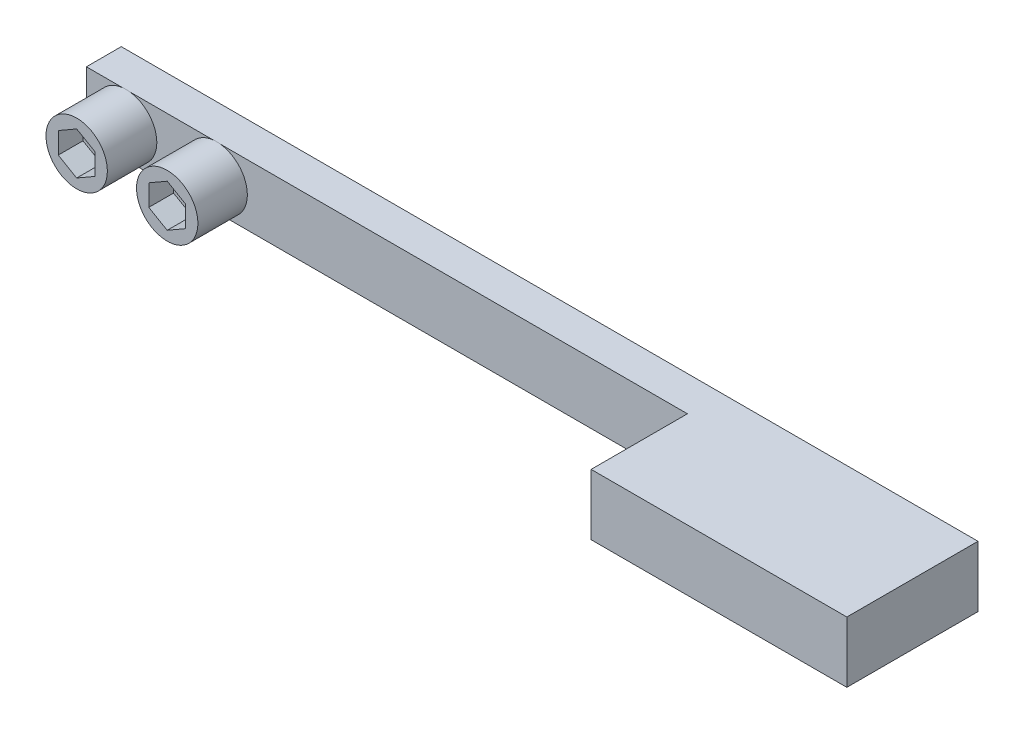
ISO-10303-21;
HEADER;
FILE_DESCRIPTION(('STEP AP214'),'2;1');
FILE_NAME('part.step','',(''),(''),'','','');
FILE_SCHEMA(('AUTOMOTIVE_DESIGN { 1 0 10303 214 1 1 1 1 }'));
ENDSEC;
DATA;
#1=APPLICATION_CONTEXT('core data for automotive mechanical design processes');
#2=APPLICATION_PROTOCOL_DEFINITION('international standard','automotive_design',2000,#1);
#3=PRODUCT_CONTEXT('',#1,'mechanical');
#4=PRODUCT('Part','Part','',(#3));
#5=PRODUCT_RELATED_PRODUCT_CATEGORY('part','',(#4));
#6=PRODUCT_DEFINITION_FORMATION('','',#4);
#7=PRODUCT_DEFINITION_CONTEXT('part definition',#1,'design');
#8=PRODUCT_DEFINITION('design','',#6,#7);
#9=PRODUCT_DEFINITION_SHAPE('','',#8);
#10=(LENGTH_UNIT() NAMED_UNIT(*) SI_UNIT(.MILLI.,.METRE.));
#11=(NAMED_UNIT(*) PLANE_ANGLE_UNIT() SI_UNIT($,.RADIAN.));
#12=(NAMED_UNIT(*) SI_UNIT($,.STERADIAN.) SOLID_ANGLE_UNIT());
#13=UNCERTAINTY_MEASURE_WITH_UNIT(LENGTH_MEASURE(1.E-05),#10,'distance_accuracy_value','');
#14=(GEOMETRIC_REPRESENTATION_CONTEXT(3) GLOBAL_UNCERTAINTY_ASSIGNED_CONTEXT((#13)) GLOBAL_UNIT_ASSIGNED_CONTEXT((#10,
#11,#12)) REPRESENTATION_CONTEXT('',''));
#15=CARTESIAN_POINT('',(0.,0.,0.));
#16=DIRECTION('',(0.,0.,1.));
#17=DIRECTION('',(1.,0.,0.));
#18=AXIS2_PLACEMENT_3D('',#15,#16,#17);
#19=CARTESIAN_POINT('',(-24.638,1.7526,1.0033));
#20=DIRECTION('',(0.,0.,-1.));
#21=DIRECTION('',(-1.,0.,0.));
#22=AXIS2_PLACEMENT_3D('',#19,#20,#21);
#23=PLANE('',#22);
#24=CARTESIAN_POINT('',(-17.145,0.,1.0033));
#25=DIRECTION('',(0.,0.,1.));
#26=DIRECTION('',(1.,0.,0.));
#27=AXIS2_PLACEMENT_3D('',#24,#25,#26);
#28=CIRCLE('',#27,1.7653);
#29=CARTESIAN_POINT('',(-16.9336298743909,-1.7526,1.0033));
#30=VERTEX_POINT('',#29);
#31=CARTESIAN_POINT('',(-16.9336298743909,1.7526,1.0033));
#32=VERTEX_POINT('',#31);
#33=EDGE_CURVE('E230',#30,#32,#28,.T.);
#34=ORIENTED_EDGE('',*,*,#33,.F.);
#35=DIRECTION('',(1.,0.,0.));
#36=VECTOR('',#35,1.);
#37=CARTESIAN_POINT('',(-24.638,-1.7526,1.0033));
#38=LINE('',#37,#36);
#39=CARTESIAN_POINT('',(9.9314,-1.7526,1.0033));
#40=VERTEX_POINT('',#39);
#41=EDGE_CURVE('E328',#30,#40,#38,.T.);
#42=ORIENTED_EDGE('',*,*,#41,.T.);
#43=DIRECTION('',(0.,-1.,0.));
#44=VECTOR('',#43,1.);
#45=CARTESIAN_POINT('',(9.9314,1.7526,1.0033));
#46=LINE('',#45,#44);
#47=CARTESIAN_POINT('',(9.9314,1.7526,1.0033));
#48=VERTEX_POINT('',#47);
#49=EDGE_CURVE('E346',#48,#40,#46,.T.);
#50=ORIENTED_EDGE('',*,*,#49,.F.);
#51=DIRECTION('',(1.,0.,0.));
#52=VECTOR('',#51,1.);
#53=CARTESIAN_POINT('',(-24.638,1.7526,1.0033));
#54=LINE('',#53,#52);
#55=EDGE_CURVE('E56',#32,#48,#54,.T.);
#56=ORIENTED_EDGE('',*,*,#55,.F.);
#57=EDGE_LOOP('',(#34,#42,#50,#56));
#58=FACE_BOUND('',#57,.T.);
#59=ADVANCED_FACE('F33',(#58),#23,.F.);
#60=CARTESIAN_POINT('',(-17.3563701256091,1.7526,1.0033));
#61=VERTEX_POINT('',#60);
#62=CARTESIAN_POINT('',(-17.3563701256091,-1.7526,1.0033));
#63=VERTEX_POINT('',#62);
#64=EDGE_CURVE('E245',#61,#63,#28,.T.);
#65=ORIENTED_EDGE('',*,*,#64,.F.);
#66=CARTESIAN_POINT('',(-22.1406298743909,1.7526,1.0033));
#67=VERTEX_POINT('',#66);
#68=EDGE_CURVE('E317',#67,#61,#54,.T.);
#69=ORIENTED_EDGE('',*,*,#68,.F.);
#70=CARTESIAN_POINT('',(-22.352,0.,1.0033));
#71=DIRECTION('',(0.,0.,1.));
#72=DIRECTION('',(1.,0.,0.));
#73=AXIS2_PLACEMENT_3D('',#70,#71,#72);
#74=CIRCLE('',#73,1.7653);
#75=CARTESIAN_POINT('',(-22.1406298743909,-1.7526,1.0033));
#76=VERTEX_POINT('',#75);
#77=EDGE_CURVE('E285',#76,#67,#74,.T.);
#78=ORIENTED_EDGE('',*,*,#77,.F.);
#79=EDGE_CURVE('E361',#76,#63,#38,.T.);
#80=ORIENTED_EDGE('',*,*,#79,.T.);
#81=EDGE_LOOP('',(#65,#69,#78,#80));
#82=FACE_BOUND('',#81,.T.);
#83=ADVANCED_FACE('F419',(#82),#23,.F.);
#84=CARTESIAN_POINT('',(-22.5633701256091,1.7526,1.0033));
#85=VERTEX_POINT('',#84);
#86=CARTESIAN_POINT('',(-22.5633701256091,-1.7526,1.0033));
#87=VERTEX_POINT('',#86);
#88=EDGE_CURVE('E303',#85,#87,#74,.T.);
#89=ORIENTED_EDGE('',*,*,#88,.F.);
#90=CARTESIAN_POINT('',(-24.638,1.7526,1.0033));
#91=VERTEX_POINT('',#90);
#92=EDGE_CURVE('E313',#91,#85,#54,.T.);
#93=ORIENTED_EDGE('',*,*,#92,.F.);
#94=DIRECTION('',(0.,-1.,0.));
#95=VECTOR('',#94,1.);
#96=CARTESIAN_POINT('',(-24.638,1.7526,1.0033));
#97=LINE('',#96,#95);
#98=CARTESIAN_POINT('',(-24.638,-1.7526,1.0033));
#99=VERTEX_POINT('',#98);
#100=EDGE_CURVE('E41',#91,#99,#97,.T.);
#101=ORIENTED_EDGE('',*,*,#100,.T.);
#102=EDGE_CURVE('E329',#99,#87,#38,.T.);
#103=ORIENTED_EDGE('',*,*,#102,.T.);
#104=EDGE_LOOP('',(#89,#93,#101,#103));
#105=FACE_BOUND('',#104,.T.);
#106=ADVANCED_FACE('F353',(#105),#23,.F.);
#107=CARTESIAN_POINT('',(24.638,1.7526,-1.0033));
#108=DIRECTION('',(0.,0.,1.));
#109=DIRECTION('',(1.,0.,0.));
#110=AXIS2_PLACEMENT_3D('',#107,#108,#109);
#111=PLANE('',#110);
#112=DIRECTION('',(-1.,0.,0.));
#113=VECTOR('',#112,1.);
#114=CARTESIAN_POINT('',(24.638,-1.7526,-1.0033));
#115=LINE('',#114,#113);
#116=CARTESIAN_POINT('',(24.638,-1.7526,-1.0033));
#117=VERTEX_POINT('',#116);
#118=CARTESIAN_POINT('',(-24.638,-1.7526,-1.0033));
#119=VERTEX_POINT('',#118);
#120=EDGE_CURVE('E306',#117,#119,#115,.T.);
#121=ORIENTED_EDGE('',*,*,#120,.T.);
#122=DIRECTION('',(0.,-1.,0.));
#123=VECTOR('',#122,1.);
#124=CARTESIAN_POINT('',(-24.638,1.7526,-1.0033));
#125=LINE('',#124,#123);
#126=CARTESIAN_POINT('',(-24.638,1.7526,-1.0033));
#127=VERTEX_POINT('',#126);
#128=EDGE_CURVE('E11',#127,#119,#125,.T.);
#129=ORIENTED_EDGE('',*,*,#128,.F.);
#130=DIRECTION('',(-1.,0.,0.));
#131=VECTOR('',#130,1.);
#132=CARTESIAN_POINT('',(24.638,1.7526,-1.0033));
#133=LINE('',#132,#131);
#134=CARTESIAN_POINT('',(24.638,1.7526,-1.0033));
#135=VERTEX_POINT('',#134);
#136=EDGE_CURVE('E307',#135,#127,#133,.T.);
#137=ORIENTED_EDGE('',*,*,#136,.F.);
#138=DIRECTION('',(0.,-1.,0.));
#139=VECTOR('',#138,1.);
#140=CARTESIAN_POINT('',(24.638,1.7526,-1.0033));
#141=LINE('',#140,#139);
#142=EDGE_CURVE('E323',#135,#117,#141,.T.);
#143=ORIENTED_EDGE('',*,*,#142,.T.);
#144=EDGE_LOOP('',(#121,#129,#137,#143));
#145=FACE_BOUND('',#144,.T.);
#146=ADVANCED_FACE('F35',(#145),#111,.F.);
#147=CARTESIAN_POINT('',(-24.638,1.7526,-1.0033));
#148=DIRECTION('',(1.,0.,0.));
#149=DIRECTION('',(0.,0.,-1.));
#150=AXIS2_PLACEMENT_3D('',#147,#148,#149);
#151=PLANE('',#150);
#152=DIRECTION('',(0.,0.,1.));
#153=VECTOR('',#152,1.);
#154=CARTESIAN_POINT('',(-24.638,-1.7526,-1.0033));
#155=LINE('',#154,#153);
#156=EDGE_CURVE('E326',#119,#99,#155,.T.);
#157=ORIENTED_EDGE('',*,*,#156,.T.);
#158=ORIENTED_EDGE('',*,*,#100,.F.);
#159=DIRECTION('',(0.,0.,1.));
#160=VECTOR('',#159,1.);
#161=CARTESIAN_POINT('',(-24.638,1.7526,-1.0033));
#162=LINE('',#161,#160);
#163=EDGE_CURVE('E310',#127,#91,#162,.T.);
#164=ORIENTED_EDGE('',*,*,#163,.F.);
#165=ORIENTED_EDGE('',*,*,#128,.T.);
#166=EDGE_LOOP('',(#157,#158,#164,#165));
#167=FACE_BOUND('',#166,.T.);
#168=ADVANCED_FACE('F429',(#167),#151,.F.);
#169=CARTESIAN_POINT('',(9.9314,1.7526,1.0033));
#170=DIRECTION('',(1.,0.,0.));
#171=DIRECTION('',(0.,0.,-1.));
#172=AXIS2_PLACEMENT_3D('',#169,#170,#171);
#173=PLANE('',#172);
#174=DIRECTION('',(0.,0.,1.));
#175=VECTOR('',#174,1.);
#176=CARTESIAN_POINT('',(9.9314,-1.7526,1.0033));
#177=LINE('',#176,#175);
#178=CARTESIAN_POINT('',(9.9314,-1.7526,6.5405));
#179=VERTEX_POINT('',#178);
#180=EDGE_CURVE('E332',#40,#179,#177,.T.);
#181=ORIENTED_EDGE('',*,*,#180,.T.);
#182=DIRECTION('',(0.,-1.,0.));
#183=VECTOR('',#182,1.);
#184=CARTESIAN_POINT('',(9.9314,1.7526,6.5405));
#185=LINE('',#184,#183);
#186=CARTESIAN_POINT('',(9.9314,1.7526,6.5405));
#187=VERTEX_POINT('',#186);
#188=EDGE_CURVE('E343',#187,#179,#185,.T.);
#189=ORIENTED_EDGE('',*,*,#188,.F.);
#190=DIRECTION('',(0.,0.,1.));
#191=VECTOR('',#190,1.);
#192=CARTESIAN_POINT('',(9.9314,1.7526,1.0033));
#193=LINE('',#192,#191);
#194=EDGE_CURVE('E316',#48,#187,#193,.T.);
#195=ORIENTED_EDGE('',*,*,#194,.F.);
#196=ORIENTED_EDGE('',*,*,#49,.T.);
#197=EDGE_LOOP('',(#181,#189,#195,#196));
#198=FACE_BOUND('',#197,.T.);
#199=ADVANCED_FACE('F375',(#198),#173,.F.);
#200=CARTESIAN_POINT('',(9.9314,1.7526,6.5405));
#201=DIRECTION('',(0.,0.,-1.));
#202=DIRECTION('',(-1.,0.,0.));
#203=AXIS2_PLACEMENT_3D('',#200,#201,#202);
#204=PLANE('',#203);
#205=DIRECTION('',(1.,0.,0.));
#206=VECTOR('',#205,1.);
#207=CARTESIAN_POINT('',(9.9314,-1.7526,6.5405));
#208=LINE('',#207,#206);
#209=CARTESIAN_POINT('',(24.638,-1.7526,6.5405));
#210=VERTEX_POINT('',#209);
#211=EDGE_CURVE('E335',#179,#210,#208,.T.);
#212=ORIENTED_EDGE('',*,*,#211,.T.);
#213=DIRECTION('',(0.,-1.,0.));
#214=VECTOR('',#213,1.);
#215=CARTESIAN_POINT('',(24.638,1.7526,6.5405));
#216=LINE('',#215,#214);
#217=CARTESIAN_POINT('',(24.638,1.7526,6.5405));
#218=VERTEX_POINT('',#217);
#219=EDGE_CURVE('E340',#218,#210,#216,.T.);
#220=ORIENTED_EDGE('',*,*,#219,.F.);
#221=DIRECTION('',(1.,0.,0.));
#222=VECTOR('',#221,1.);
#223=CARTESIAN_POINT('',(9.9314,1.7526,6.5405));
#224=LINE('',#223,#222);
#225=EDGE_CURVE('E319',#187,#218,#224,.T.);
#226=ORIENTED_EDGE('',*,*,#225,.F.);
#227=ORIENTED_EDGE('',*,*,#188,.T.);
#228=EDGE_LOOP('',(#212,#220,#226,#227));
#229=FACE_BOUND('',#228,.T.);
#230=ADVANCED_FACE('F381',(#229),#204,.F.);
#231=CARTESIAN_POINT('',(24.638,1.7526,6.5405));
#232=DIRECTION('',(-1.,0.,0.));
#233=DIRECTION('',(0.,0.,1.));
#234=AXIS2_PLACEMENT_3D('',#231,#232,#233);
#235=PLANE('',#234);
#236=DIRECTION('',(0.,0.,-1.));
#237=VECTOR('',#236,1.);
#238=CARTESIAN_POINT('',(24.638,-1.7526,6.5405));
#239=LINE('',#238,#237);
#240=EDGE_CURVE('E311',#210,#117,#239,.T.);
#241=ORIENTED_EDGE('',*,*,#240,.T.);
#242=ORIENTED_EDGE('',*,*,#142,.F.);
#243=DIRECTION('',(0.,0.,-1.));
#244=VECTOR('',#243,1.);
#245=CARTESIAN_POINT('',(24.638,1.7526,6.5405));
#246=LINE('',#245,#244);
#247=EDGE_CURVE('E321',#218,#135,#246,.T.);
#248=ORIENTED_EDGE('',*,*,#247,.F.);
#249=ORIENTED_EDGE('',*,*,#219,.T.);
#250=EDGE_LOOP('',(#241,#242,#248,#249));
#251=FACE_BOUND('',#250,.T.);
#252=ADVANCED_FACE('F385',(#251),#235,.F.);
#253=CARTESIAN_POINT('',(-24.638,1.7526,-1.0033));
#254=DIRECTION('',(0.,1.,0.));
#255=DIRECTION('',(0.,0.,1.));
#256=AXIS2_PLACEMENT_3D('',#253,#254,#255);
#257=PLANE('',#256);
#258=ORIENTED_EDGE('',*,*,#136,.T.);
#259=ORIENTED_EDGE('',*,*,#163,.T.);
#260=ORIENTED_EDGE('',*,*,#92,.T.);
#261=DIRECTION('',(1.,0.,0.));
#262=VECTOR('',#261,1.);
#263=CARTESIAN_POINT('',(-24.638,1.7526,1.0033));
#264=LINE('',#263,#262);
#265=EDGE_CURVE('E299',#85,#67,#264,.T.);
#266=ORIENTED_EDGE('',*,*,#265,.T.);
#267=ORIENTED_EDGE('',*,*,#68,.T.);
#268=DIRECTION('',(1.,0.,0.));
#269=VECTOR('',#268,1.);
#270=CARTESIAN_POINT('',(-24.638,1.7526,1.0033));
#271=LINE('',#270,#269);
#272=EDGE_CURVE('E241',#61,#32,#271,.T.);
#273=ORIENTED_EDGE('',*,*,#272,.T.);
#274=ORIENTED_EDGE('',*,*,#55,.T.);
#275=ORIENTED_EDGE('',*,*,#194,.T.);
#276=ORIENTED_EDGE('',*,*,#225,.T.);
#277=ORIENTED_EDGE('',*,*,#247,.T.);
#278=EDGE_LOOP('',(#258,#259,#260,#266,#267,#273,#274,#275,#276,#277));
#279=FACE_BOUND('',#278,.T.);
#280=ADVANCED_FACE('F389',(#279),#257,.T.);
#281=CARTESIAN_POINT('',(-24.638,-1.7526,-1.0033));
#282=DIRECTION('',(0.,1.,0.));
#283=DIRECTION('',(0.,0.,1.));
#284=AXIS2_PLACEMENT_3D('',#281,#282,#283);
#285=PLANE('',#284);
#286=ORIENTED_EDGE('',*,*,#120,.F.);
#287=ORIENTED_EDGE('',*,*,#240,.F.);
#288=ORIENTED_EDGE('',*,*,#211,.F.);
#289=ORIENTED_EDGE('',*,*,#180,.F.);
#290=ORIENTED_EDGE('',*,*,#41,.F.);
#291=EDGE_CURVE('E365',#63,#30,#38,.T.);
#292=ORIENTED_EDGE('',*,*,#291,.F.);
#293=ORIENTED_EDGE('',*,*,#79,.F.);
#294=EDGE_CURVE('E333',#87,#76,#38,.T.);
#295=ORIENTED_EDGE('',*,*,#294,.F.);
#296=ORIENTED_EDGE('',*,*,#102,.F.);
#297=ORIENTED_EDGE('',*,*,#156,.F.);
#298=EDGE_LOOP('',(#286,#287,#288,#289,#290,#292,#293,#295,#296,#297));
#299=FACE_BOUND('',#298,.T.);
#300=ADVANCED_FACE('F358',(#299),#285,.F.);
#301=CARTESIAN_POINT('',(-22.352,0.,1.0033));
#302=DIRECTION('',(0.,0.,1.));
#303=DIRECTION('',(1.,0.,0.));
#304=AXIS2_PLACEMENT_3D('',#301,#302,#303);
#305=PLANE('',#304);
#306=EDGE_CURVE('E440',#87,#76,#74,.T.);
#307=ORIENTED_EDGE('',*,*,#306,.F.);
#308=ORIENTED_EDGE('',*,*,#294,.T.);
#309=EDGE_LOOP('',(#307,#308));
#310=FACE_BOUND('',#309,.T.);
#311=ADVANCED_FACE('F441',(#310),#305,.F.);
#312=CARTESIAN_POINT('',(-22.352,0.,3.8481));
#313=DIRECTION('',(0.,0.,-1.));
#314=DIRECTION('',(-1.,0.,0.));
#315=AXIS2_PLACEMENT_3D('',#312,#313,#314);
#316=CYLINDRICAL_SURFACE('',#315,1.7653);
#317=CARTESIAN_POINT('',(-22.352,0.,3.8481));
#318=DIRECTION('',(0.,0.,1.));
#319=DIRECTION('',(1.,0.,0.));
#320=AXIS2_PLACEMENT_3D('',#317,#318,#319);
#321=CIRCLE('',#320,1.7653);
#322=CARTESIAN_POINT('',(-20.5867,0.,3.8481));
#323=VERTEX_POINT('',#322);
#324=EDGE_CURVE('E296',#323,#323,#321,.T.);
#325=ORIENTED_EDGE('',*,*,#324,.F.);
#326=EDGE_LOOP('',(#325));
#327=FACE_BOUND('',#326,.T.);
#328=EDGE_CURVE('E300',#67,#85,#74,.T.);
#329=ORIENTED_EDGE('',*,*,#328,.T.);
#330=ORIENTED_EDGE('',*,*,#88,.T.);
#331=ORIENTED_EDGE('',*,*,#306,.T.);
#332=ORIENTED_EDGE('',*,*,#77,.T.);
#333=EDGE_LOOP('',(#329,#330,#331,#332));
#334=FACE_BOUND('',#333,.T.);
#335=ADVANCED_FACE('F439',(#327,#334),#316,.T.);
#336=CARTESIAN_POINT('',(-22.352,0.,3.8481));
#337=DIRECTION('',(0.,0.,1.));
#338=DIRECTION('',(1.,0.,0.));
#339=AXIS2_PLACEMENT_3D('',#336,#337,#338);
#340=PLANE('',#339);
#341=DIRECTION('',(-0.866025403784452,-0.499999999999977,0.));
#342=VECTOR('',#341,1.);
#343=CARTESIAN_POINT('',(-22.352,1.2230357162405,3.8481));
#344=LINE('',#343,#342);
#345=CARTESIAN_POINT('',(-22.352,1.2230357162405,3.8481));
#346=VERTEX_POINT('',#345);
#347=CARTESIAN_POINT('',(-23.41118,0.61151785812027,3.8481));
#348=VERTEX_POINT('',#347);
#349=EDGE_CURVE('E247',#346,#348,#344,.T.);
#350=ORIENTED_EDGE('',*,*,#349,.F.);
#351=DIRECTION('',(-0.866025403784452,0.499999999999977,0.));
#352=VECTOR('',#351,1.);
#353=CARTESIAN_POINT('',(-21.29282,0.61151785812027,3.8481));
#354=LINE('',#353,#352);
#355=CARTESIAN_POINT('',(-21.29282,0.61151785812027,3.8481));
#356=VERTEX_POINT('',#355);
#357=EDGE_CURVE('E252',#356,#346,#354,.T.);
#358=ORIENTED_EDGE('',*,*,#357,.F.);
#359=DIRECTION('',(0.,1.,0.));
#360=VECTOR('',#359,1.);
#361=CARTESIAN_POINT('',(-21.29282,-0.61151785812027,3.8481));
#362=LINE('',#361,#360);
#363=CARTESIAN_POINT('',(-21.29282,-0.61151785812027,3.8481));
#364=VERTEX_POINT('',#363);
#365=EDGE_CURVE('E278',#364,#356,#362,.T.);
#366=ORIENTED_EDGE('',*,*,#365,.F.);
#367=DIRECTION('',(0.866025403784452,0.499999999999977,0.));
#368=VECTOR('',#367,1.);
#369=CARTESIAN_POINT('',(-22.352,-1.2230357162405,3.8481));
#370=LINE('',#369,#368);
#371=CARTESIAN_POINT('',(-22.352,-1.2230357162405,3.8481));
#372=VERTEX_POINT('',#371);
#373=EDGE_CURVE('E275',#372,#364,#370,.T.);
#374=ORIENTED_EDGE('',*,*,#373,.F.);
#375=DIRECTION('',(0.866025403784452,-0.499999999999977,0.));
#376=VECTOR('',#375,1.);
#377=CARTESIAN_POINT('',(-23.41118,-0.61151785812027,3.8481));
#378=LINE('',#377,#376);
#379=CARTESIAN_POINT('',(-23.41118,-0.61151785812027,3.8481));
#380=VERTEX_POINT('',#379);
#381=EDGE_CURVE('E272',#380,#372,#378,.T.);
#382=ORIENTED_EDGE('',*,*,#381,.F.);
#383=DIRECTION('',(0.,-1.,0.));
#384=VECTOR('',#383,1.);
#385=CARTESIAN_POINT('',(-23.41118,0.61151785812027,3.8481));
#386=LINE('',#385,#384);
#387=EDGE_CURVE('E269',#348,#380,#386,.T.);
#388=ORIENTED_EDGE('',*,*,#387,.F.);
#389=EDGE_LOOP('',(#350,#358,#366,#374,#382,#388));
#390=FACE_BOUND('',#389,.T.);
#391=ORIENTED_EDGE('',*,*,#324,.T.);
#392=EDGE_LOOP('',(#391));
#393=FACE_BOUND('',#392,.T.);
#394=ADVANCED_FACE('F448',(#390,#393),#340,.T.);
#395=ORIENTED_EDGE('',*,*,#265,.F.);
#396=ORIENTED_EDGE('',*,*,#328,.F.);
#397=EDGE_LOOP('',(#395,#396));
#398=FACE_BOUND('',#397,.T.);
#399=ADVANCED_FACE('F436',(#398),#305,.F.);
#400=CARTESIAN_POINT('',(-22.352,1.2230357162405,2.4257));
#401=DIRECTION('',(-0.499999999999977,0.866025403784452,0.));
#402=DIRECTION('',(-0.866025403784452,-0.499999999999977,0.));
#403=AXIS2_PLACEMENT_3D('',#400,#401,#402);
#404=PLANE('',#403);
#405=ORIENTED_EDGE('',*,*,#349,.T.);
#406=DIRECTION('',(0.,0.,1.));
#407=VECTOR('',#406,1.);
#408=CARTESIAN_POINT('',(-23.41118,0.61151785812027,2.4257));
#409=LINE('',#408,#407);
#410=CARTESIAN_POINT('',(-23.41118,0.61151785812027,2.4257));
#411=VERTEX_POINT('',#410);
#412=EDGE_CURVE('E267',#411,#348,#409,.T.);
#413=ORIENTED_EDGE('',*,*,#412,.F.);
#414=DIRECTION('',(-0.866025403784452,-0.499999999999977,0.));
#415=VECTOR('',#414,1.);
#416=CARTESIAN_POINT('',(-22.352,1.2230357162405,2.4257));
#417=LINE('',#416,#415);
#418=CARTESIAN_POINT('',(-22.352,1.2230357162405,2.4257));
#419=VERTEX_POINT('',#418);
#420=EDGE_CURVE('E248',#419,#411,#417,.T.);
#421=ORIENTED_EDGE('',*,*,#420,.F.);
#422=DIRECTION('',(0.,0.,1.));
#423=VECTOR('',#422,1.);
#424=CARTESIAN_POINT('',(-22.352,1.2230357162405,2.4257));
#425=LINE('',#424,#423);
#426=EDGE_CURVE('E283',#419,#346,#425,.T.);
#427=ORIENTED_EDGE('',*,*,#426,.T.);
#428=EDGE_LOOP('',(#405,#413,#421,#427));
#429=FACE_BOUND('',#428,.T.);
#430=ADVANCED_FACE('F454',(#429),#404,.F.);
#431=CARTESIAN_POINT('',(-21.29282,0.61151785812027,2.4257));
#432=DIRECTION('',(0.499999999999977,0.866025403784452,0.));
#433=DIRECTION('',(-0.866025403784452,0.499999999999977,0.));
#434=AXIS2_PLACEMENT_3D('',#431,#432,#433);
#435=PLANE('',#434);
#436=ORIENTED_EDGE('',*,*,#357,.T.);
#437=ORIENTED_EDGE('',*,*,#426,.F.);
#438=DIRECTION('',(-0.866025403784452,0.499999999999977,0.));
#439=VECTOR('',#438,1.);
#440=CARTESIAN_POINT('',(-21.29282,0.61151785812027,2.4257));
#441=LINE('',#440,#439);
#442=CARTESIAN_POINT('',(-21.29282,0.61151785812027,2.4257));
#443=VERTEX_POINT('',#442);
#444=EDGE_CURVE('E264',#443,#419,#441,.T.);
#445=ORIENTED_EDGE('',*,*,#444,.F.);
#446=DIRECTION('',(0.,0.,1.));
#447=VECTOR('',#446,1.);
#448=CARTESIAN_POINT('',(-21.29282,0.61151785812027,2.4257));
#449=LINE('',#448,#447);
#450=EDGE_CURVE('E286',#443,#356,#449,.T.);
#451=ORIENTED_EDGE('',*,*,#450,.T.);
#452=EDGE_LOOP('',(#436,#437,#445,#451));
#453=FACE_BOUND('',#452,.T.);
#454=ADVANCED_FACE('F459',(#453),#435,.F.);
#455=CARTESIAN_POINT('',(-21.29282,-0.61151785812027,2.4257));
#456=DIRECTION('',(1.,0.,0.));
#457=DIRECTION('',(0.,0.,-1.));
#458=AXIS2_PLACEMENT_3D('',#455,#456,#457);
#459=PLANE('',#458);
#460=ORIENTED_EDGE('',*,*,#365,.T.);
#461=ORIENTED_EDGE('',*,*,#450,.F.);
#462=DIRECTION('',(0.,1.,0.));
#463=VECTOR('',#462,1.);
#464=CARTESIAN_POINT('',(-21.29282,-0.61151785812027,2.4257));
#465=LINE('',#464,#463);
#466=CARTESIAN_POINT('',(-21.29282,-0.61151785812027,2.4257));
#467=VERTEX_POINT('',#466);
#468=EDGE_CURVE('E261',#467,#443,#465,.T.);
#469=ORIENTED_EDGE('',*,*,#468,.F.);
#470=DIRECTION('',(0.,0.,1.));
#471=VECTOR('',#470,1.);
#472=CARTESIAN_POINT('',(-21.29282,-0.61151785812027,2.4257));
#473=LINE('',#472,#471);
#474=EDGE_CURVE('E288',#467,#364,#473,.T.);
#475=ORIENTED_EDGE('',*,*,#474,.T.);
#476=EDGE_LOOP('',(#460,#461,#469,#475));
#477=FACE_BOUND('',#476,.T.);
#478=ADVANCED_FACE('F478',(#477),#459,.F.);
#479=CARTESIAN_POINT('',(-22.352,-1.2230357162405,2.4257));
#480=DIRECTION('',(0.499999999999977,-0.866025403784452,0.));
#481=DIRECTION('',(0.866025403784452,0.499999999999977,0.));
#482=AXIS2_PLACEMENT_3D('',#479,#480,#481);
#483=PLANE('',#482);
#484=ORIENTED_EDGE('',*,*,#373,.T.);
#485=ORIENTED_EDGE('',*,*,#474,.F.);
#486=DIRECTION('',(0.866025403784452,0.499999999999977,0.));
#487=VECTOR('',#486,1.);
#488=CARTESIAN_POINT('',(-22.352,-1.2230357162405,2.4257));
#489=LINE('',#488,#487);
#490=CARTESIAN_POINT('',(-22.352,-1.2230357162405,2.4257));
#491=VERTEX_POINT('',#490);
#492=EDGE_CURVE('E258',#491,#467,#489,.T.);
#493=ORIENTED_EDGE('',*,*,#492,.F.);
#494=DIRECTION('',(0.,0.,1.));
#495=VECTOR('',#494,1.);
#496=CARTESIAN_POINT('',(-22.352,-1.2230357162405,2.4257));
#497=LINE('',#496,#495);
#498=EDGE_CURVE('E290',#491,#372,#497,.T.);
#499=ORIENTED_EDGE('',*,*,#498,.T.);
#500=EDGE_LOOP('',(#484,#485,#493,#499));
#501=FACE_BOUND('',#500,.T.);
#502=ADVANCED_FACE('F474',(#501),#483,.F.);
#503=CARTESIAN_POINT('',(-23.41118,-0.61151785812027,2.4257));
#504=DIRECTION('',(-0.499999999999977,-0.866025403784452,0.));
#505=DIRECTION('',(0.866025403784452,-0.499999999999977,0.));
#506=AXIS2_PLACEMENT_3D('',#503,#504,#505);
#507=PLANE('',#506);
#508=ORIENTED_EDGE('',*,*,#381,.T.);
#509=ORIENTED_EDGE('',*,*,#498,.F.);
#510=DIRECTION('',(0.866025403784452,-0.499999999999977,0.));
#511=VECTOR('',#510,1.);
#512=CARTESIAN_POINT('',(-23.41118,-0.61151785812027,2.4257));
#513=LINE('',#512,#511);
#514=CARTESIAN_POINT('',(-23.41118,-0.61151785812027,2.4257));
#515=VERTEX_POINT('',#514);
#516=EDGE_CURVE('E255',#515,#491,#513,.T.);
#517=ORIENTED_EDGE('',*,*,#516,.F.);
#518=DIRECTION('',(0.,0.,1.));
#519=VECTOR('',#518,1.);
#520=CARTESIAN_POINT('',(-23.41118,-0.61151785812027,2.4257));
#521=LINE('',#520,#519);
#522=EDGE_CURVE('E292',#515,#380,#521,.T.);
#523=ORIENTED_EDGE('',*,*,#522,.T.);
#524=EDGE_LOOP('',(#508,#509,#517,#523));
#525=FACE_BOUND('',#524,.T.);
#526=ADVANCED_FACE('F470',(#525),#507,.F.);
#527=CARTESIAN_POINT('',(-23.41118,0.61151785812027,2.4257));
#528=DIRECTION('',(-1.,0.,0.));
#529=DIRECTION('',(0.,0.,1.));
#530=AXIS2_PLACEMENT_3D('',#527,#528,#529);
#531=PLANE('',#530);
#532=ORIENTED_EDGE('',*,*,#387,.T.);
#533=ORIENTED_EDGE('',*,*,#522,.F.);
#534=DIRECTION('',(0.,-1.,0.));
#535=VECTOR('',#534,1.);
#536=CARTESIAN_POINT('',(-23.41118,0.61151785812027,2.4257));
#537=LINE('',#536,#535);
#538=EDGE_CURVE('E251',#411,#515,#537,.T.);
#539=ORIENTED_EDGE('',*,*,#538,.F.);
#540=ORIENTED_EDGE('',*,*,#412,.T.);
#541=EDGE_LOOP('',(#532,#533,#539,#540));
#542=FACE_BOUND('',#541,.T.);
#543=ADVANCED_FACE('F413',(#542),#531,.F.);
#544=CARTESIAN_POINT('',(-23.41118,0.61151785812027,2.4257));
#545=DIRECTION('',(0.,0.,1.));
#546=DIRECTION('',(1.,0.,0.));
#547=AXIS2_PLACEMENT_3D('',#544,#545,#546);
#548=PLANE('',#547);
#549=ORIENTED_EDGE('',*,*,#420,.T.);
#550=ORIENTED_EDGE('',*,*,#538,.T.);
#551=ORIENTED_EDGE('',*,*,#516,.T.);
#552=ORIENTED_EDGE('',*,*,#492,.T.);
#553=ORIENTED_EDGE('',*,*,#468,.T.);
#554=ORIENTED_EDGE('',*,*,#444,.T.);
#555=EDGE_LOOP('',(#549,#550,#551,#552,#553,#554));
#556=FACE_BOUND('',#555,.T.);
#557=ADVANCED_FACE('F404',(#556),#548,.T.);
#558=CARTESIAN_POINT('',(-17.145,0.,1.0033));
#559=DIRECTION('',(0.,0.,1.));
#560=DIRECTION('',(1.,0.,0.));
#561=AXIS2_PLACEMENT_3D('',#558,#559,#560);
#562=PLANE('',#561);
#563=EDGE_CURVE('E401',#63,#30,#28,.T.);
#564=ORIENTED_EDGE('',*,*,#563,.F.);
#565=ORIENTED_EDGE('',*,*,#291,.T.);
#566=EDGE_LOOP('',(#564,#565));
#567=FACE_BOUND('',#566,.T.);
#568=ADVANCED_FACE('F402',(#567),#562,.F.);
#569=CARTESIAN_POINT('',(-17.145,0.,3.8481));
#570=DIRECTION('',(0.,0.,-1.));
#571=DIRECTION('',(-1.,0.,0.));
#572=AXIS2_PLACEMENT_3D('',#569,#570,#571);
#573=CYLINDRICAL_SURFACE('',#572,1.7653);
#574=CARTESIAN_POINT('',(-17.145,0.,3.8481));
#575=DIRECTION('',(0.,0.,1.));
#576=DIRECTION('',(1.,0.,0.));
#577=AXIS2_PLACEMENT_3D('',#574,#575,#576);
#578=CIRCLE('',#577,1.7653);
#579=CARTESIAN_POINT('',(-15.3797,0.,3.8481));
#580=VERTEX_POINT('',#579);
#581=EDGE_CURVE('E238',#580,#580,#578,.T.);
#582=ORIENTED_EDGE('',*,*,#581,.F.);
#583=EDGE_LOOP('',(#582));
#584=FACE_BOUND('',#583,.T.);
#585=EDGE_CURVE('E242',#32,#61,#28,.T.);
#586=ORIENTED_EDGE('',*,*,#585,.T.);
#587=ORIENTED_EDGE('',*,*,#64,.T.);
#588=ORIENTED_EDGE('',*,*,#563,.T.);
#589=ORIENTED_EDGE('',*,*,#33,.T.);
#590=EDGE_LOOP('',(#586,#587,#588,#589));
#591=FACE_BOUND('',#590,.T.);
#592=ADVANCED_FACE('F400',(#584,#591),#573,.T.);
#593=CARTESIAN_POINT('',(-17.145,0.,3.8481));
#594=DIRECTION('',(0.,0.,1.));
#595=DIRECTION('',(1.,0.,0.));
#596=AXIS2_PLACEMENT_3D('',#593,#594,#595);
#597=PLANE('',#596);
#598=DIRECTION('',(-0.866025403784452,-0.499999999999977,0.));
#599=VECTOR('',#598,1.);
#600=CARTESIAN_POINT('',(-17.145,1.2230357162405,3.8481));
#601=LINE('',#600,#599);
#602=CARTESIAN_POINT('',(-17.145,1.2230357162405,3.8481));
#603=VERTEX_POINT('',#602);
#604=CARTESIAN_POINT('',(-18.20418,0.61151785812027,3.8481));
#605=VERTEX_POINT('',#604);
#606=EDGE_CURVE('E48',#603,#605,#601,.T.);
#607=ORIENTED_EDGE('',*,*,#606,.F.);
#608=DIRECTION('',(-0.866025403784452,0.499999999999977,0.));
#609=VECTOR('',#608,1.);
#610=CARTESIAN_POINT('',(-16.08582,0.61151785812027,3.8481));
#611=LINE('',#610,#609);
#612=CARTESIAN_POINT('',(-16.08582,0.61151785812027,3.8481));
#613=VERTEX_POINT('',#612);
#614=EDGE_CURVE('E204',#613,#603,#611,.T.);
#615=ORIENTED_EDGE('',*,*,#614,.F.);
#616=DIRECTION('',(0.,1.,0.));
#617=VECTOR('',#616,1.);
#618=CARTESIAN_POINT('',(-16.08582,-0.61151785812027,3.8481));
#619=LINE('',#618,#617);
#620=CARTESIAN_POINT('',(-16.08582,-0.61151785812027,3.8481));
#621=VERTEX_POINT('',#620);
#622=EDGE_CURVE('E207',#621,#613,#619,.T.);
#623=ORIENTED_EDGE('',*,*,#622,.F.);
#624=DIRECTION('',(0.866025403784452,0.499999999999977,0.));
#625=VECTOR('',#624,1.);
#626=CARTESIAN_POINT('',(-17.145,-1.2230357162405,3.8481));
#627=LINE('',#626,#625);
#628=CARTESIAN_POINT('',(-17.145,-1.2230357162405,3.8481));
#629=VERTEX_POINT('',#628);
#630=EDGE_CURVE('E223',#629,#621,#627,.T.);
#631=ORIENTED_EDGE('',*,*,#630,.F.);
#632=DIRECTION('',(0.866025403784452,-0.499999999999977,0.));
#633=VECTOR('',#632,1.);
#634=CARTESIAN_POINT('',(-18.20418,-0.61151785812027,3.8481));
#635=LINE('',#634,#633);
#636=CARTESIAN_POINT('',(-18.20418,-0.61151785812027,3.8481));
#637=VERTEX_POINT('',#636);
#638=EDGE_CURVE('E220',#637,#629,#635,.T.);
#639=ORIENTED_EDGE('',*,*,#638,.F.);
#640=DIRECTION('',(0.,-1.,0.));
#641=VECTOR('',#640,1.);
#642=CARTESIAN_POINT('',(-18.20418,0.61151785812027,3.8481));
#643=LINE('',#642,#641);
#644=EDGE_CURVE('E218',#605,#637,#643,.T.);
#645=ORIENTED_EDGE('',*,*,#644,.F.);
#646=EDGE_LOOP('',(#607,#615,#623,#631,#639,#645));
#647=FACE_BOUND('',#646,.T.);
#648=ORIENTED_EDGE('',*,*,#581,.T.);
#649=EDGE_LOOP('',(#648));
#650=FACE_BOUND('',#649,.T.);
#651=ADVANCED_FACE('F410',(#647,#650),#597,.T.);
#652=ORIENTED_EDGE('',*,*,#272,.F.);
#653=ORIENTED_EDGE('',*,*,#585,.F.);
#654=EDGE_LOOP('',(#652,#653));
#655=FACE_BOUND('',#654,.T.);
#656=ADVANCED_FACE('F397',(#655),#562,.F.);
#657=CARTESIAN_POINT('',(-17.145,1.2230357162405,2.4257));
#658=DIRECTION('',(-0.499999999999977,0.866025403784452,0.));
#659=DIRECTION('',(-0.866025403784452,-0.499999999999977,0.));
#660=AXIS2_PLACEMENT_3D('',#657,#658,#659);
#661=PLANE('',#660);
#662=ORIENTED_EDGE('',*,*,#606,.T.);
#663=DIRECTION('',(0.,0.,1.));
#664=VECTOR('',#663,1.);
#665=CARTESIAN_POINT('',(-18.20418,0.61151785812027,2.4257));
#666=LINE('',#665,#664);
#667=CARTESIAN_POINT('',(-18.20418,0.61151785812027,2.4257));
#668=VERTEX_POINT('',#667);
#669=EDGE_CURVE('E181',#668,#605,#666,.T.);
#670=ORIENTED_EDGE('',*,*,#669,.F.);
#671=DIRECTION('',(-0.866025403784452,-0.499999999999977,0.));
#672=VECTOR('',#671,1.);
#673=CARTESIAN_POINT('',(-17.145,1.2230357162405,2.4257));
#674=LINE('',#673,#672);
#675=CARTESIAN_POINT('',(-17.145,1.2230357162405,2.4257));
#676=VERTEX_POINT('',#675);
#677=EDGE_CURVE('E185',#676,#668,#674,.T.);
#678=ORIENTED_EDGE('',*,*,#677,.F.);
#679=DIRECTION('',(0.,0.,1.));
#680=VECTOR('',#679,1.);
#681=CARTESIAN_POINT('',(-17.145,1.2230357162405,2.4257));
#682=LINE('',#681,#680);
#683=EDGE_CURVE('E228',#676,#603,#682,.T.);
#684=ORIENTED_EDGE('',*,*,#683,.T.);
#685=EDGE_LOOP('',(#662,#670,#678,#684));
#686=FACE_BOUND('',#685,.T.);
#687=ADVANCED_FACE('F183',(#686),#661,.F.);
#688=CARTESIAN_POINT('',(-16.08582,0.61151785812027,2.4257));
#689=DIRECTION('',(0.499999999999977,0.866025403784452,0.));
#690=DIRECTION('',(-0.866025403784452,0.499999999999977,0.));
#691=AXIS2_PLACEMENT_3D('',#688,#689,#690);
#692=PLANE('',#691);
#693=ORIENTED_EDGE('',*,*,#614,.T.);
#694=ORIENTED_EDGE('',*,*,#683,.F.);
#695=DIRECTION('',(-0.866025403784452,0.499999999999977,0.));
#696=VECTOR('',#695,1.);
#697=CARTESIAN_POINT('',(-16.08582,0.61151785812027,2.4257));
#698=LINE('',#697,#696);
#699=CARTESIAN_POINT('',(-16.08582,0.61151785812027,2.4257));
#700=VERTEX_POINT('',#699);
#701=EDGE_CURVE('E191',#700,#676,#698,.T.);
#702=ORIENTED_EDGE('',*,*,#701,.F.);
#703=DIRECTION('',(0.,0.,1.));
#704=VECTOR('',#703,1.);
#705=CARTESIAN_POINT('',(-16.08582,0.61151785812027,2.4257));
#706=LINE('',#705,#704);
#707=EDGE_CURVE('E231',#700,#613,#706,.T.);
#708=ORIENTED_EDGE('',*,*,#707,.T.);
#709=EDGE_LOOP('',(#693,#694,#702,#708));
#710=FACE_BOUND('',#709,.T.);
#711=ADVANCED_FACE('F580',(#710),#692,.F.);
#712=CARTESIAN_POINT('',(-16.08582,-0.61151785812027,2.4257));
#713=DIRECTION('',(1.,0.,0.));
#714=DIRECTION('',(0.,0.,-1.));
#715=AXIS2_PLACEMENT_3D('',#712,#713,#714);
#716=PLANE('',#715);
#717=ORIENTED_EDGE('',*,*,#622,.T.);
#718=ORIENTED_EDGE('',*,*,#707,.F.);
#719=DIRECTION('',(0.,1.,0.));
#720=VECTOR('',#719,1.);
#721=CARTESIAN_POINT('',(-16.08582,-0.61151785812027,2.4257));
#722=LINE('',#721,#720);
#723=CARTESIAN_POINT('',(-16.08582,-0.61151785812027,2.4257));
#724=VERTEX_POINT('',#723);
#725=EDGE_CURVE('E214',#724,#700,#722,.T.);
#726=ORIENTED_EDGE('',*,*,#725,.F.);
#727=DIRECTION('',(0.,0.,1.));
#728=VECTOR('',#727,1.);
#729=CARTESIAN_POINT('',(-16.08582,-0.61151785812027,2.4257));
#730=LINE('',#729,#728);
#731=EDGE_CURVE('E233',#724,#621,#730,.T.);
#732=ORIENTED_EDGE('',*,*,#731,.T.);
#733=EDGE_LOOP('',(#717,#718,#726,#732));
#734=FACE_BOUND('',#733,.T.);
#735=ADVANCED_FACE('F589',(#734),#716,.F.);
#736=CARTESIAN_POINT('',(-17.145,-1.2230357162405,2.4257));
#737=DIRECTION('',(0.499999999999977,-0.866025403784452,0.));
#738=DIRECTION('',(0.866025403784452,0.499999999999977,0.));
#739=AXIS2_PLACEMENT_3D('',#736,#737,#738);
#740=PLANE('',#739);
#741=ORIENTED_EDGE('',*,*,#630,.T.);
#742=ORIENTED_EDGE('',*,*,#731,.F.);
#743=DIRECTION('',(0.866025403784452,0.499999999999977,0.));
#744=VECTOR('',#743,1.);
#745=CARTESIAN_POINT('',(-17.145,-1.2230357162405,2.4257));
#746=LINE('',#745,#744);
#747=CARTESIAN_POINT('',(-17.145,-1.2230357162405,2.4257));
#748=VERTEX_POINT('',#747);
#749=EDGE_CURVE('E211',#748,#724,#746,.T.);
#750=ORIENTED_EDGE('',*,*,#749,.F.);
#751=DIRECTION('',(0.,0.,1.));
#752=VECTOR('',#751,1.);
#753=CARTESIAN_POINT('',(-17.145,-1.2230357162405,2.4257));
#754=LINE('',#753,#752);
#755=EDGE_CURVE('E235',#748,#629,#754,.T.);
#756=ORIENTED_EDGE('',*,*,#755,.T.);
#757=EDGE_LOOP('',(#741,#742,#750,#756));
#758=FACE_BOUND('',#757,.T.);
#759=ADVANCED_FACE('F599',(#758),#740,.F.);
#760=CARTESIAN_POINT('',(-18.20418,-0.61151785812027,2.4257));
#761=DIRECTION('',(-0.499999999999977,-0.866025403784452,0.));
#762=DIRECTION('',(0.866025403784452,-0.499999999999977,0.));
#763=AXIS2_PLACEMENT_3D('',#760,#761,#762);
#764=PLANE('',#763);
#765=ORIENTED_EDGE('',*,*,#638,.T.);
#766=ORIENTED_EDGE('',*,*,#755,.F.);
#767=DIRECTION('',(0.866025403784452,-0.499999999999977,0.));
#768=VECTOR('',#767,1.);
#769=CARTESIAN_POINT('',(-18.20418,-0.61151785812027,2.4257));
#770=LINE('',#769,#768);
#771=CARTESIAN_POINT('',(-18.20418,-0.61151785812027,2.4257));
#772=VERTEX_POINT('',#771);
#773=EDGE_CURVE('E199',#772,#748,#770,.T.);
#774=ORIENTED_EDGE('',*,*,#773,.F.);
#775=DIRECTION('',(0.,0.,1.));
#776=VECTOR('',#775,1.);
#777=CARTESIAN_POINT('',(-18.20418,-0.61151785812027,2.4257));
#778=LINE('',#777,#776);
#779=EDGE_CURVE('E190',#772,#637,#778,.T.);
#780=ORIENTED_EDGE('',*,*,#779,.T.);
#781=EDGE_LOOP('',(#765,#766,#774,#780));
#782=FACE_BOUND('',#781,.T.);
#783=ADVANCED_FACE('F609',(#782),#764,.F.);
#784=CARTESIAN_POINT('',(-18.20418,0.61151785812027,2.4257));
#785=DIRECTION('',(-1.,0.,0.));
#786=DIRECTION('',(0.,0.,1.));
#787=AXIS2_PLACEMENT_3D('',#784,#785,#786);
#788=PLANE('',#787);
#789=ORIENTED_EDGE('',*,*,#644,.T.);
#790=ORIENTED_EDGE('',*,*,#779,.F.);
#791=DIRECTION('',(0.,-1.,0.));
#792=VECTOR('',#791,1.);
#793=CARTESIAN_POINT('',(-18.20418,0.61151785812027,2.4257));
#794=LINE('',#793,#792);
#795=EDGE_CURVE('E194',#668,#772,#794,.T.);
#796=ORIENTED_EDGE('',*,*,#795,.F.);
#797=ORIENTED_EDGE('',*,*,#669,.T.);
#798=EDGE_LOOP('',(#789,#790,#796,#797));
#799=FACE_BOUND('',#798,.T.);
#800=ADVANCED_FACE('F195',(#799),#788,.F.);
#801=CARTESIAN_POINT('',(-18.20418,0.61151785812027,2.4257));
#802=DIRECTION('',(0.,0.,1.));
#803=DIRECTION('',(1.,0.,0.));
#804=AXIS2_PLACEMENT_3D('',#801,#802,#803);
#805=PLANE('',#804);
#806=ORIENTED_EDGE('',*,*,#677,.T.);
#807=ORIENTED_EDGE('',*,*,#795,.T.);
#808=ORIENTED_EDGE('',*,*,#773,.T.);
#809=ORIENTED_EDGE('',*,*,#749,.T.);
#810=ORIENTED_EDGE('',*,*,#725,.T.);
#811=ORIENTED_EDGE('',*,*,#701,.T.);
#812=EDGE_LOOP('',(#806,#807,#808,#809,#810,#811));
#813=FACE_BOUND('',#812,.T.);
#814=ADVANCED_FACE('F201',(#813),#805,.T.);
#815=CLOSED_SHELL('',(#59,#83,#106,#146,#168,#199,#230,#252,#280,#300,#311,#335,#394,#399,#430,
#454,#478,#502,#526,#543,#557,#568,#592,#651,#656,#687,#711,#735,#759,#783,#800,#814));
#816=MANIFOLD_SOLID_BREP('B2',#815);
#817=ADVANCED_BREP_SHAPE_REPRESENTATION('',(#18,#816),#14);
#818=SHAPE_DEFINITION_REPRESENTATION(#9,#817);
ENDSEC;
END-ISO-10303-21;
